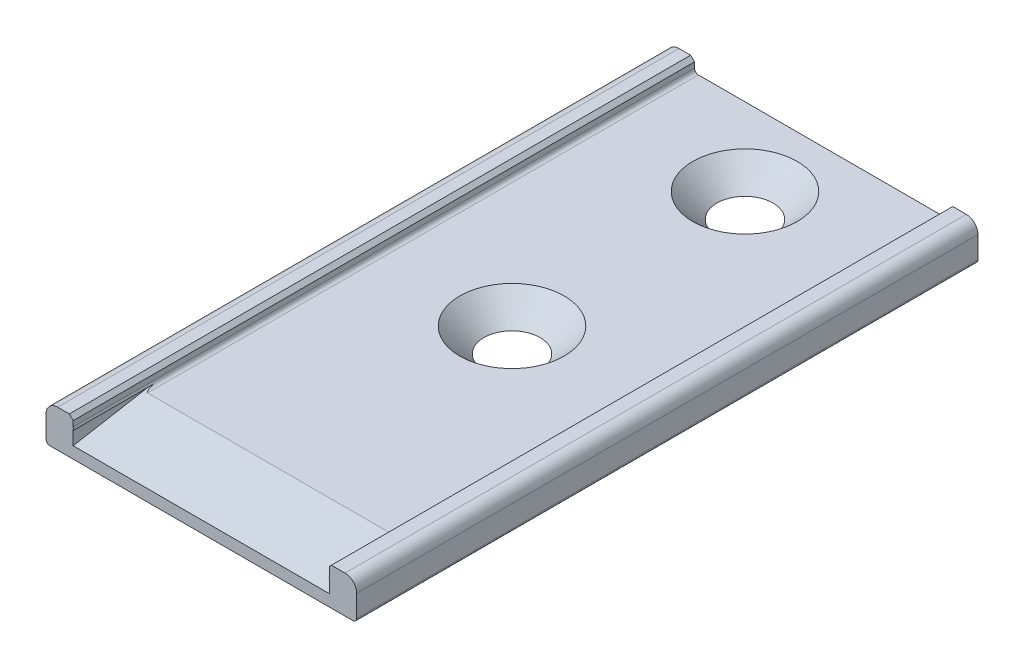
ISO-10303-21;
HEADER;
FILE_DESCRIPTION(('STEP AP214'),'2;1');
FILE_NAME('part.step','',(''),(''),'','','');
FILE_SCHEMA(('AUTOMOTIVE_DESIGN { 1 0 10303 214 1 1 1 1 }'));
ENDSEC;
DATA;
#1=APPLICATION_CONTEXT('core data for automotive mechanical design processes');
#2=APPLICATION_PROTOCOL_DEFINITION('international standard','automotive_design',2000,#1);
#3=PRODUCT_CONTEXT('',#1,'mechanical');
#4=PRODUCT('Part','Part','',(#3));
#5=PRODUCT_RELATED_PRODUCT_CATEGORY('part','',(#4));
#6=PRODUCT_DEFINITION_FORMATION('','',#4);
#7=PRODUCT_DEFINITION_CONTEXT('part definition',#1,'design');
#8=PRODUCT_DEFINITION('design','',#6,#7);
#9=PRODUCT_DEFINITION_SHAPE('','',#8);
#10=(LENGTH_UNIT() NAMED_UNIT(*) SI_UNIT(.MILLI.,.METRE.));
#11=(NAMED_UNIT(*) PLANE_ANGLE_UNIT() SI_UNIT($,.RADIAN.));
#12=(NAMED_UNIT(*) SI_UNIT($,.STERADIAN.) SOLID_ANGLE_UNIT());
#13=UNCERTAINTY_MEASURE_WITH_UNIT(LENGTH_MEASURE(1.E-05),#10,'distance_accuracy_value','');
#14=(GEOMETRIC_REPRESENTATION_CONTEXT(3) GLOBAL_UNCERTAINTY_ASSIGNED_CONTEXT((#13)) GLOBAL_UNIT_ASSIGNED_CONTEXT((#10,
#11,#12)) REPRESENTATION_CONTEXT('',''));
#15=CARTESIAN_POINT('',(0.,0.,0.));
#16=DIRECTION('',(0.,0.,1.));
#17=DIRECTION('',(1.,0.,0.));
#18=AXIS2_PLACEMENT_3D('',#15,#16,#17);
#19=CARTESIAN_POINT('',(39.5,0.5,-80.));
#20=DIRECTION('',(0.,0.,1.));
#21=DIRECTION('',(1.,0.,0.));
#22=AXIS2_PLACEMENT_3D('',#19,#20,#21);
#23=CYLINDRICAL_SURFACE('',#22,0.5);
#24=CARTESIAN_POINT('',(39.5,0.5,0.));
#25=DIRECTION('',(0.,0.,1.));
#26=DIRECTION('',(1.,0.,0.));
#27=AXIS2_PLACEMENT_3D('',#24,#25,#26);
#28=CIRCLE('',#27,0.5);
#29=CARTESIAN_POINT('',(39.5,0.,0.));
#30=VERTEX_POINT('',#29);
#31=CARTESIAN_POINT('',(40.,0.500000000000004,0.));
#32=VERTEX_POINT('',#31);
#33=EDGE_CURVE('E269',#30,#32,#28,.T.);
#34=ORIENTED_EDGE('',*,*,#33,.F.);
#35=DIRECTION('',(0.,0.,1.));
#36=VECTOR('',#35,1.);
#37=CARTESIAN_POINT('',(39.5,0.,-80.));
#38=LINE('',#37,#36);
#39=CARTESIAN_POINT('',(39.5,0.,-80.));
#40=VERTEX_POINT('',#39);
#41=EDGE_CURVE('E114',#40,#30,#38,.T.);
#42=ORIENTED_EDGE('',*,*,#41,.F.);
#43=CARTESIAN_POINT('',(39.5,0.5,-80.));
#44=DIRECTION('',(0.,0.,1.));
#45=DIRECTION('',(1.,0.,0.));
#46=AXIS2_PLACEMENT_3D('',#43,#44,#45);
#47=CIRCLE('',#46,0.5);
#48=CARTESIAN_POINT('',(40.,0.500000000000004,-80.));
#49=VERTEX_POINT('',#48);
#50=EDGE_CURVE('E326',#40,#49,#47,.T.);
#51=ORIENTED_EDGE('',*,*,#50,.T.);
#52=DIRECTION('',(0.,0.,1.));
#53=VECTOR('',#52,1.);
#54=CARTESIAN_POINT('',(40.,0.500000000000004,-80.));
#55=LINE('',#54,#53);
#56=EDGE_CURVE('E179',#49,#32,#55,.T.);
#57=ORIENTED_EDGE('',*,*,#56,.T.);
#58=EDGE_LOOP('',(#34,#42,#51,#57));
#59=FACE_BOUND('',#58,.T.);
#60=ADVANCED_FACE('F86',(#59),#23,.T.);
#61=CARTESIAN_POINT('',(0.500000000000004,0.,-80.));
#62=DIRECTION('',(0.,-1.,0.));
#63=DIRECTION('',(0.,0.,-1.));
#64=AXIS2_PLACEMENT_3D('',#61,#62,#63);
#65=PLANE('',#64);
#66=CARTESIAN_POINT('',(20.,0.,-40.));
#67=DIRECTION('',(0.,-1.,0.));
#68=DIRECTION('',(0.,0.,-1.));
#69=AXIS2_PLACEMENT_3D('',#66,#67,#68);
#70=CIRCLE('',#69,3.61999999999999);
#71=CARTESIAN_POINT('',(20.,0.,-43.62));
#72=VERTEX_POINT('',#71);
#73=EDGE_CURVE('E444',#72,#72,#70,.T.);
#74=ORIENTED_EDGE('',*,*,#73,.F.);
#75=EDGE_LOOP('',(#74));
#76=FACE_BOUND('',#75,.T.);
#77=CARTESIAN_POINT('',(20.,0.,-70.));
#78=DIRECTION('',(0.,-1.,0.));
#79=DIRECTION('',(0.,0.,-1.));
#80=AXIS2_PLACEMENT_3D('',#77,#78,#79);
#81=CIRCLE('',#80,3.61999999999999);
#82=CARTESIAN_POINT('',(20.,0.,-73.62));
#83=VERTEX_POINT('',#82);
#84=EDGE_CURVE('E274',#83,#83,#81,.T.);
#85=ORIENTED_EDGE('',*,*,#84,.F.);
#86=EDGE_LOOP('',(#85));
#87=FACE_BOUND('',#86,.T.);
#88=DIRECTION('',(1.,0.,0.));
#89=VECTOR('',#88,1.);
#90=CARTESIAN_POINT('',(0.500000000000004,0.,0.));
#91=LINE('',#90,#89);
#92=CARTESIAN_POINT('',(0.500000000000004,0.,0.));
#93=VERTEX_POINT('',#92);
#94=EDGE_CURVE('E322',#93,#30,#91,.T.);
#95=ORIENTED_EDGE('',*,*,#94,.F.);
#96=DIRECTION('',(0.,0.,1.));
#97=VECTOR('',#96,1.);
#98=CARTESIAN_POINT('',(0.500000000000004,0.,-80.));
#99=LINE('',#98,#97);
#100=CARTESIAN_POINT('',(0.500000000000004,0.,-80.));
#101=VERTEX_POINT('',#100);
#102=EDGE_CURVE('E246',#101,#93,#99,.T.);
#103=ORIENTED_EDGE('',*,*,#102,.F.);
#104=DIRECTION('',(1.,0.,0.));
#105=VECTOR('',#104,1.);
#106=CARTESIAN_POINT('',(0.500000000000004,0.,-80.));
#107=LINE('',#106,#105);
#108=EDGE_CURVE('E255',#101,#40,#107,.T.);
#109=ORIENTED_EDGE('',*,*,#108,.T.);
#110=ORIENTED_EDGE('',*,*,#41,.T.);
#111=EDGE_LOOP('',(#95,#103,#109,#110));
#112=FACE_BOUND('',#111,.T.);
#113=ADVANCED_FACE('F555',(#76,#87,#112),#65,.T.);
#114=CARTESIAN_POINT('',(0.5,0.5,-80.));
#115=DIRECTION('',(0.,0.,1.));
#116=DIRECTION('',(1.,0.,0.));
#117=AXIS2_PLACEMENT_3D('',#114,#115,#116);
#118=CYLINDRICAL_SURFACE('',#117,0.5);
#119=CARTESIAN_POINT('',(0.5,0.5,0.));
#120=DIRECTION('',(0.,0.,1.));
#121=DIRECTION('',(1.,0.,0.));
#122=AXIS2_PLACEMENT_3D('',#119,#120,#121);
#123=CIRCLE('',#122,0.5);
#124=CARTESIAN_POINT('',(0.,0.500000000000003,0.));
#125=VERTEX_POINT('',#124);
#126=EDGE_CURVE('E240',#125,#93,#123,.T.);
#127=ORIENTED_EDGE('',*,*,#126,.F.);
#128=DIRECTION('',(0.,0.,1.));
#129=VECTOR('',#128,1.);
#130=CARTESIAN_POINT('',(0.,0.500000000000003,-80.));
#131=LINE('',#130,#129);
#132=CARTESIAN_POINT('',(0.,0.500000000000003,-80.));
#133=VERTEX_POINT('',#132);
#134=EDGE_CURVE('E234',#133,#125,#131,.T.);
#135=ORIENTED_EDGE('',*,*,#134,.F.);
#136=CARTESIAN_POINT('',(0.5,0.5,-80.));
#137=DIRECTION('',(0.,0.,1.));
#138=DIRECTION('',(1.,0.,0.));
#139=AXIS2_PLACEMENT_3D('',#136,#137,#138);
#140=CIRCLE('',#139,0.5);
#141=EDGE_CURVE('E237',#133,#101,#140,.T.);
#142=ORIENTED_EDGE('',*,*,#141,.T.);
#143=ORIENTED_EDGE('',*,*,#102,.T.);
#144=EDGE_LOOP('',(#127,#135,#142,#143));
#145=FACE_BOUND('',#144,.T.);
#146=ADVANCED_FACE('F236',(#145),#118,.T.);
#147=CARTESIAN_POINT('',(0.,0.500000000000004,-80.));
#148=DIRECTION('',(-1.,0.,0.));
#149=DIRECTION('',(0.,0.,1.));
#150=AXIS2_PLACEMENT_3D('',#147,#148,#149);
#151=PLANE('',#150);
#152=DIRECTION('',(0.,-1.,0.));
#153=VECTOR('',#152,1.);
#154=CARTESIAN_POINT('',(0.,0.500000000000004,0.));
#155=LINE('',#154,#153);
#156=CARTESIAN_POINT('',(0.,3.3,0.));
#157=VERTEX_POINT('',#156);
#158=EDGE_CURVE('E317',#157,#125,#155,.T.);
#159=ORIENTED_EDGE('',*,*,#158,.F.);
#160=DIRECTION('',(0.,0.,1.));
#161=VECTOR('',#160,1.);
#162=CARTESIAN_POINT('',(0.,3.3,-80.));
#163=LINE('',#162,#161);
#164=CARTESIAN_POINT('',(0.,3.3,-80.));
#165=VERTEX_POINT('',#164);
#166=EDGE_CURVE('E247',#165,#157,#163,.T.);
#167=ORIENTED_EDGE('',*,*,#166,.F.);
#168=DIRECTION('',(0.,-1.,0.));
#169=VECTOR('',#168,1.);
#170=CARTESIAN_POINT('',(0.,0.500000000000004,-80.));
#171=LINE('',#170,#169);
#172=EDGE_CURVE('E253',#165,#133,#171,.T.);
#173=ORIENTED_EDGE('',*,*,#172,.T.);
#174=ORIENTED_EDGE('',*,*,#134,.T.);
#175=EDGE_LOOP('',(#159,#167,#173,#174));
#176=FACE_BOUND('',#175,.T.);
#177=ADVANCED_FACE('F258',(#176),#151,.T.);
#178=CARTESIAN_POINT('',(1.5,3.3,-80.));
#179=DIRECTION('',(0.,0.,1.));
#180=DIRECTION('',(1.,0.,0.));
#181=AXIS2_PLACEMENT_3D('',#178,#179,#180);
#182=CYLINDRICAL_SURFACE('',#181,1.5);
#183=CARTESIAN_POINT('',(1.5,3.3,0.));
#184=DIRECTION('',(0.,0.,1.));
#185=DIRECTION('',(-1.,0.,0.));
#186=AXIS2_PLACEMENT_3D('',#183,#184,#185);
#187=CIRCLE('',#186,1.5);
#188=CARTESIAN_POINT('',(1.5,4.8,0.));
#189=VERTEX_POINT('',#188);
#190=EDGE_CURVE('E313',#189,#157,#187,.T.);
#191=ORIENTED_EDGE('',*,*,#190,.F.);
#192=DIRECTION('',(0.,0.,1.));
#193=VECTOR('',#192,1.);
#194=CARTESIAN_POINT('',(1.5,4.8,-80.));
#195=LINE('',#194,#193);
#196=CARTESIAN_POINT('',(1.5,4.8,-80.));
#197=VERTEX_POINT('',#196);
#198=EDGE_CURVE('E334',#197,#189,#195,.T.);
#199=ORIENTED_EDGE('',*,*,#198,.F.);
#200=CARTESIAN_POINT('',(1.5,3.3,-80.));
#201=DIRECTION('',(0.,0.,1.));
#202=DIRECTION('',(-1.,0.,0.));
#203=AXIS2_PLACEMENT_3D('',#200,#201,#202);
#204=CIRCLE('',#203,1.5);
#205=EDGE_CURVE('E260',#197,#165,#204,.T.);
#206=ORIENTED_EDGE('',*,*,#205,.T.);
#207=ORIENTED_EDGE('',*,*,#166,.T.);
#208=EDGE_LOOP('',(#191,#199,#206,#207));
#209=FACE_BOUND('',#208,.T.);
#210=ADVANCED_FACE('F562',(#209),#182,.T.);
#211=CARTESIAN_POINT('',(1.5,4.8,-80.));
#212=DIRECTION('',(0.,1.,0.));
#213=DIRECTION('',(-1.,0.,0.));
#214=AXIS2_PLACEMENT_3D('',#211,#212,#213);
#215=PLANE('',#214);
#216=DIRECTION('',(-1.,0.,0.));
#217=VECTOR('',#216,1.);
#218=CARTESIAN_POINT('',(1.5,4.8,0.));
#219=LINE('',#218,#217);
#220=CARTESIAN_POINT('',(3.,4.8,0.));
#221=VERTEX_POINT('',#220);
#222=EDGE_CURVE('E309',#221,#189,#219,.T.);
#223=ORIENTED_EDGE('',*,*,#222,.F.);
#224=DIRECTION('',(0.,0.,1.));
#225=VECTOR('',#224,1.);
#226=CARTESIAN_POINT('',(3.,4.8,-80.));
#227=LINE('',#226,#225);
#228=CARTESIAN_POINT('',(3.,4.8,-80.));
#229=VERTEX_POINT('',#228);
#230=EDGE_CURVE('E337',#229,#221,#227,.T.);
#231=ORIENTED_EDGE('',*,*,#230,.F.);
#232=DIRECTION('',(-1.,0.,0.));
#233=VECTOR('',#232,1.);
#234=CARTESIAN_POINT('',(1.5,4.8,-80.));
#235=LINE('',#234,#233);
#236=EDGE_CURVE('E263',#229,#197,#235,.T.);
#237=ORIENTED_EDGE('',*,*,#236,.T.);
#238=ORIENTED_EDGE('',*,*,#198,.T.);
#239=EDGE_LOOP('',(#223,#231,#237,#238));
#240=FACE_BOUND('',#239,.T.);
#241=ADVANCED_FACE('F500',(#240),#215,.T.);
#242=CARTESIAN_POINT('',(3.,4.8,-80.));
#243=DIRECTION('',(0.707106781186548,0.707106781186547,0.));
#244=DIRECTION('',(-0.707106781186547,0.707106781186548,0.));
#245=AXIS2_PLACEMENT_3D('',#242,#243,#244);
#246=PLANE('',#245);
#247=DIRECTION('',(-0.707106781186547,0.707106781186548,0.));
#248=VECTOR('',#247,1.);
#249=CARTESIAN_POINT('',(3.,4.8,0.));
#250=LINE('',#249,#248);
#251=CARTESIAN_POINT('',(3.5,4.3,0.));
#252=VERTEX_POINT('',#251);
#253=EDGE_CURVE('E305',#252,#221,#250,.T.);
#254=ORIENTED_EDGE('',*,*,#253,.F.);
#255=DIRECTION('',(0.,0.,1.));
#256=VECTOR('',#255,1.);
#257=CARTESIAN_POINT('',(3.5,4.3,-80.));
#258=LINE('',#257,#256);
#259=CARTESIAN_POINT('',(3.5,4.3,-80.));
#260=VERTEX_POINT('',#259);
#261=EDGE_CURVE('E340',#260,#252,#258,.T.);
#262=ORIENTED_EDGE('',*,*,#261,.F.);
#263=DIRECTION('',(-0.707106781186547,0.707106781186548,0.));
#264=VECTOR('',#263,1.);
#265=CARTESIAN_POINT('',(3.,4.8,-80.));
#266=LINE('',#265,#264);
#267=EDGE_CURVE('E492',#260,#229,#266,.T.);
#268=ORIENTED_EDGE('',*,*,#267,.T.);
#269=ORIENTED_EDGE('',*,*,#230,.T.);
#270=EDGE_LOOP('',(#254,#262,#268,#269));
#271=FACE_BOUND('',#270,.T.);
#272=ADVANCED_FACE('F506',(#271),#246,.T.);
#273=CARTESIAN_POINT('',(3.5,4.3,-80.));
#274=DIRECTION('',(1.,0.,0.));
#275=DIRECTION('',(0.,1.,0.));
#276=AXIS2_PLACEMENT_3D('',#273,#274,#275);
#277=PLANE('',#276);
#278=DIRECTION('',(0.,1.,0.));
#279=VECTOR('',#278,1.);
#280=CARTESIAN_POINT('',(3.5,4.3,0.));
#281=LINE('',#280,#279);
#282=CARTESIAN_POINT('',(3.5,3.6,0.));
#283=VERTEX_POINT('',#282);
#284=EDGE_CURVE('E301',#283,#252,#281,.T.);
#285=ORIENTED_EDGE('',*,*,#284,.F.);
#286=DIRECTION('',(0.,0.,1.));
#287=VECTOR('',#286,1.);
#288=CARTESIAN_POINT('',(3.5,3.6,-80.));
#289=LINE('',#288,#287);
#290=CARTESIAN_POINT('',(3.5,3.6,-80.));
#291=VERTEX_POINT('',#290);
#292=EDGE_CURVE('E343',#291,#283,#289,.T.);
#293=ORIENTED_EDGE('',*,*,#292,.F.);
#294=DIRECTION('',(0.,1.,0.));
#295=VECTOR('',#294,1.);
#296=CARTESIAN_POINT('',(3.5,4.3,-80.));
#297=LINE('',#296,#295);
#298=EDGE_CURVE('E488',#291,#260,#297,.T.);
#299=ORIENTED_EDGE('',*,*,#298,.T.);
#300=ORIENTED_EDGE('',*,*,#261,.T.);
#301=EDGE_LOOP('',(#285,#293,#299,#300));
#302=FACE_BOUND('',#301,.T.);
#303=ADVANCED_FACE('F509',(#302),#277,.T.);
#304=CARTESIAN_POINT('',(4.,3.6,-80.));
#305=DIRECTION('',(0.,0.,1.));
#306=DIRECTION('',(1.,0.,0.));
#307=AXIS2_PLACEMENT_3D('',#304,#305,#306);
#308=CYLINDRICAL_SURFACE('',#307,0.5);
#309=DIRECTION('',(0.,0.,1.));
#310=VECTOR('',#309,1.);
#311=CARTESIAN_POINT('',(3.6,3.3,-80.));
#312=LINE('',#311,#310);
#313=CARTESIAN_POINT('',(3.60000000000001,3.29999999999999,-10.2083072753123));
#314=VERTEX_POINT('',#313);
#315=CARTESIAN_POINT('',(3.60000000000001,3.29999999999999,0.));
#316=VERTEX_POINT('',#315);
#317=EDGE_CURVE('E433',#314,#316,#312,.T.);
#318=ORIENTED_EDGE('',*,*,#317,.F.);
#319=CARTESIAN_POINT('',(4.,3.6,-11.9096918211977));
#320=DIRECTION('',(0.,-0.984807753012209,-0.173648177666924));
#321=DIRECTION('',(0.,-0.173648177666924,0.984807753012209));
#322=AXIS2_PLACEMENT_3D('',#319,#320,#321);
#323=ELLIPSE('',#322,2.87938524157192,0.5);
#324=CARTESIAN_POINT('',(4.,3.1,-9.07405091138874));
#325=VERTEX_POINT('',#324);
#326=EDGE_CURVE('E430',#325,#314,#323,.T.);
#327=ORIENTED_EDGE('',*,*,#326,.F.);
#328=DIRECTION('',(0.,0.,1.));
#329=VECTOR('',#328,1.);
#330=CARTESIAN_POINT('',(4.,3.1,-80.));
#331=LINE('',#330,#329);
#332=CARTESIAN_POINT('',(4.,3.1,-80.));
#333=VERTEX_POINT('',#332);
#334=EDGE_CURVE('E347',#333,#325,#331,.T.);
#335=ORIENTED_EDGE('',*,*,#334,.F.);
#336=CARTESIAN_POINT('',(4.,3.6,-80.));
#337=DIRECTION('',(0.,0.,-1.));
#338=DIRECTION('',(1.,0.,0.));
#339=AXIS2_PLACEMENT_3D('',#336,#337,#338);
#340=CIRCLE('',#339,0.5);
#341=EDGE_CURVE('E484',#333,#291,#340,.T.);
#342=ORIENTED_EDGE('',*,*,#341,.T.);
#343=ORIENTED_EDGE('',*,*,#292,.T.);
#344=CARTESIAN_POINT('',(4.,3.6,0.));
#345=DIRECTION('',(0.,0.,-1.));
#346=DIRECTION('',(1.,0.,0.));
#347=AXIS2_PLACEMENT_3D('',#344,#345,#346);
#348=CIRCLE('',#347,0.5);
#349=EDGE_CURVE('E298',#316,#283,#348,.T.);
#350=ORIENTED_EDGE('',*,*,#349,.F.);
#351=EDGE_LOOP('',(#318,#327,#335,#342,#343,#350));
#352=FACE_BOUND('',#351,.T.);
#353=ADVANCED_FACE('F514',(#352),#308,.F.);
#354=CARTESIAN_POINT('',(4.,3.1,-80.));
#355=DIRECTION('',(0.,1.,0.));
#356=DIRECTION('',(0.,0.,1.));
#357=AXIS2_PLACEMENT_3D('',#354,#355,#356);
#358=PLANE('',#357);
#359=DIRECTION('',(-1.,0.,0.));
#360=VECTOR('',#359,1.);
#361=CARTESIAN_POINT('',(3.99999999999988,3.1,-9.07405091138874));
#362=LINE('',#361,#360);
#363=CARTESIAN_POINT('',(36.,3.1,-9.07405091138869));
#364=VERTEX_POINT('',#363);
#365=EDGE_CURVE('E426',#364,#325,#362,.T.);
#366=ORIENTED_EDGE('',*,*,#365,.F.);
#367=DIRECTION('',(0.,0.,1.));
#368=VECTOR('',#367,1.);
#369=CARTESIAN_POINT('',(36.,3.1,-80.));
#370=LINE('',#369,#368);
#371=CARTESIAN_POINT('',(36.,3.1,-80.));
#372=VERTEX_POINT('',#371);
#373=EDGE_CURVE('E351',#372,#364,#370,.T.);
#374=ORIENTED_EDGE('',*,*,#373,.F.);
#375=DIRECTION('',(-1.,0.,0.));
#376=VECTOR('',#375,1.);
#377=CARTESIAN_POINT('',(4.,3.1,-80.));
#378=LINE('',#377,#376);
#379=EDGE_CURVE('E480',#372,#333,#378,.T.);
#380=ORIENTED_EDGE('',*,*,#379,.T.);
#381=ORIENTED_EDGE('',*,*,#334,.T.);
#382=EDGE_LOOP('',(#366,#374,#380,#381));
#383=FACE_BOUND('',#382,.T.);
#384=CARTESIAN_POINT('',(20.,3.1,-40.));
#385=DIRECTION('',(0.,1.,0.));
#386=DIRECTION('',(0.,0.,1.));
#387=AXIS2_PLACEMENT_3D('',#384,#385,#386);
#388=CIRCLE('',#387,6.72);
#389=CARTESIAN_POINT('',(20.,3.1,-33.28));
#390=VERTEX_POINT('',#389);
#391=EDGE_CURVE('E440',#390,#390,#388,.T.);
#392=ORIENTED_EDGE('',*,*,#391,.F.);
#393=EDGE_LOOP('',(#392));
#394=FACE_BOUND('',#393,.T.);
#395=CARTESIAN_POINT('',(20.,3.1,-70.));
#396=DIRECTION('',(0.,1.,0.));
#397=DIRECTION('',(0.,0.,1.));
#398=AXIS2_PLACEMENT_3D('',#395,#396,#397);
#399=CIRCLE('',#398,6.72);
#400=CARTESIAN_POINT('',(20.,3.1,-63.28));
#401=VERTEX_POINT('',#400);
#402=EDGE_CURVE('E448',#401,#401,#399,.T.);
#403=ORIENTED_EDGE('',*,*,#402,.F.);
#404=EDGE_LOOP('',(#403));
#405=FACE_BOUND('',#404,.T.);
#406=ADVANCED_FACE('F520',(#383,#394,#405),#358,.T.);
#407=CARTESIAN_POINT('',(36.,3.6,-80.));
#408=DIRECTION('',(0.,0.,1.));
#409=DIRECTION('',(1.,0.,0.));
#410=AXIS2_PLACEMENT_3D('',#407,#408,#409);
#411=CYLINDRICAL_SURFACE('',#410,0.5);
#412=DIRECTION('',(0.,0.,1.));
#413=VECTOR('',#412,1.);
#414=CARTESIAN_POINT('',(36.4,3.30000000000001,-80.));
#415=LINE('',#414,#413);
#416=CARTESIAN_POINT('',(36.4,3.3,0.));
#417=VERTEX_POINT('',#416);
#418=CARTESIAN_POINT('',(36.4,3.3,-10.2083072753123));
#419=VERTEX_POINT('',#418);
#420=EDGE_CURVE('E437',#417,#419,#415,.F.);
#421=ORIENTED_EDGE('',*,*,#420,.F.);
#422=CARTESIAN_POINT('',(36.,3.6,0.));
#423=DIRECTION('',(0.,0.,-1.));
#424=DIRECTION('',(-1.,0.,0.));
#425=AXIS2_PLACEMENT_3D('',#422,#423,#424);
#426=CIRCLE('',#425,0.5);
#427=CARTESIAN_POINT('',(36.5,3.6,0.));
#428=VERTEX_POINT('',#427);
#429=EDGE_CURVE('E294',#428,#417,#426,.T.);
#430=ORIENTED_EDGE('',*,*,#429,.F.);
#431=DIRECTION('',(0.,0.,1.));
#432=VECTOR('',#431,1.);
#433=CARTESIAN_POINT('',(36.5,3.6,-80.));
#434=LINE('',#433,#432);
#435=CARTESIAN_POINT('',(36.5,3.6,-80.));
#436=VERTEX_POINT('',#435);
#437=EDGE_CURVE('E355',#436,#428,#434,.T.);
#438=ORIENTED_EDGE('',*,*,#437,.F.);
#439=CARTESIAN_POINT('',(36.,3.6,-80.));
#440=DIRECTION('',(0.,0.,-1.));
#441=DIRECTION('',(-1.,0.,0.));
#442=AXIS2_PLACEMENT_3D('',#439,#440,#441);
#443=CIRCLE('',#442,0.5);
#444=EDGE_CURVE('E476',#436,#372,#443,.T.);
#445=ORIENTED_EDGE('',*,*,#444,.T.);
#446=ORIENTED_EDGE('',*,*,#373,.T.);
#447=CARTESIAN_POINT('',(36.,3.6,-11.9096918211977));
#448=DIRECTION('',(0.,-0.984807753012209,-0.173648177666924));
#449=DIRECTION('',(0.,-0.173648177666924,0.984807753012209));
#450=AXIS2_PLACEMENT_3D('',#447,#448,#449);
#451=ELLIPSE('',#450,2.87938524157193,0.5);
#452=EDGE_CURVE('E422',#419,#364,#451,.T.);
#453=ORIENTED_EDGE('',*,*,#452,.F.);
#454=EDGE_LOOP('',(#421,#430,#438,#445,#446,#453));
#455=FACE_BOUND('',#454,.T.);
#456=ADVANCED_FACE('F581',(#455),#411,.F.);
#457=CARTESIAN_POINT('',(36.5,4.55,-80.));
#458=DIRECTION('',(-1.,0.,0.));
#459=DIRECTION('',(0.,0.,1.));
#460=AXIS2_PLACEMENT_3D('',#457,#458,#459);
#461=PLANE('',#460);
#462=DIRECTION('',(0.,-1.,0.));
#463=VECTOR('',#462,1.);
#464=CARTESIAN_POINT('',(36.5,4.55,0.));
#465=LINE('',#464,#463);
#466=CARTESIAN_POINT('',(36.5,4.55,0.));
#467=VERTEX_POINT('',#466);
#468=EDGE_CURVE('E290',#467,#428,#465,.T.);
#469=ORIENTED_EDGE('',*,*,#468,.F.);
#470=DIRECTION('',(0.,0.,1.));
#471=VECTOR('',#470,1.);
#472=CARTESIAN_POINT('',(36.5,4.55,-80.));
#473=LINE('',#472,#471);
#474=CARTESIAN_POINT('',(36.5,4.55,-80.));
#475=VERTEX_POINT('',#474);
#476=EDGE_CURVE('E358',#475,#467,#473,.T.);
#477=ORIENTED_EDGE('',*,*,#476,.F.);
#478=DIRECTION('',(0.,-1.,0.));
#479=VECTOR('',#478,1.);
#480=CARTESIAN_POINT('',(36.5,4.55,-80.));
#481=LINE('',#480,#479);
#482=EDGE_CURVE('E472',#475,#436,#481,.T.);
#483=ORIENTED_EDGE('',*,*,#482,.T.);
#484=ORIENTED_EDGE('',*,*,#437,.T.);
#485=EDGE_LOOP('',(#469,#477,#483,#484));
#486=FACE_BOUND('',#485,.T.);
#487=ADVANCED_FACE('F584',(#486),#461,.T.);
#488=CARTESIAN_POINT('',(36.75,4.8,-80.));
#489=DIRECTION('',(-0.707106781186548,0.707106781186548,0.));
#490=DIRECTION('',(-0.707106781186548,-0.707106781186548,0.));
#491=AXIS2_PLACEMENT_3D('',#488,#489,#490);
#492=PLANE('',#491);
#493=DIRECTION('',(-0.707106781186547,-0.707106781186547,0.));
#494=VECTOR('',#493,1.);
#495=CARTESIAN_POINT('',(36.75,4.8,0.));
#496=LINE('',#495,#494);
#497=CARTESIAN_POINT('',(36.75,4.8,0.));
#498=VERTEX_POINT('',#497);
#499=EDGE_CURVE('E286',#498,#467,#496,.T.);
#500=ORIENTED_EDGE('',*,*,#499,.F.);
#501=DIRECTION('',(0.,0.,1.));
#502=VECTOR('',#501,1.);
#503=CARTESIAN_POINT('',(36.75,4.8,-80.));
#504=LINE('',#503,#502);
#505=CARTESIAN_POINT('',(36.75,4.8,-80.));
#506=VERTEX_POINT('',#505);
#507=EDGE_CURVE('E361',#506,#498,#504,.T.);
#508=ORIENTED_EDGE('',*,*,#507,.F.);
#509=DIRECTION('',(-0.707106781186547,-0.707106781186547,0.));
#510=VECTOR('',#509,1.);
#511=CARTESIAN_POINT('',(36.75,4.8,-80.));
#512=LINE('',#511,#510);
#513=EDGE_CURVE('E468',#506,#475,#512,.T.);
#514=ORIENTED_EDGE('',*,*,#513,.T.);
#515=ORIENTED_EDGE('',*,*,#476,.T.);
#516=EDGE_LOOP('',(#500,#508,#514,#515));
#517=FACE_BOUND('',#516,.T.);
#518=ADVANCED_FACE('F588',(#517),#492,.T.);
#519=CARTESIAN_POINT('',(36.75,4.8,-80.));
#520=DIRECTION('',(0.,1.,0.));
#521=DIRECTION('',(0.,0.,1.));
#522=AXIS2_PLACEMENT_3D('',#519,#520,#521);
#523=PLANE('',#522);
#524=DIRECTION('',(-1.,0.,0.));
#525=VECTOR('',#524,1.);
#526=CARTESIAN_POINT('',(36.75,4.8,0.));
#527=LINE('',#526,#525);
#528=CARTESIAN_POINT('',(38.5,4.8,0.));
#529=VERTEX_POINT('',#528);
#530=EDGE_CURVE('E282',#529,#498,#527,.T.);
#531=ORIENTED_EDGE('',*,*,#530,.F.);
#532=DIRECTION('',(0.,0.,1.));
#533=VECTOR('',#532,1.);
#534=CARTESIAN_POINT('',(38.5,4.8,-80.));
#535=LINE('',#534,#533);
#536=CARTESIAN_POINT('',(38.5,4.8,-80.));
#537=VERTEX_POINT('',#536);
#538=EDGE_CURVE('E364',#537,#529,#535,.T.);
#539=ORIENTED_EDGE('',*,*,#538,.F.);
#540=DIRECTION('',(-1.,0.,0.));
#541=VECTOR('',#540,1.);
#542=CARTESIAN_POINT('',(36.75,4.8,-80.));
#543=LINE('',#542,#541);
#544=EDGE_CURVE('E464',#537,#506,#543,.T.);
#545=ORIENTED_EDGE('',*,*,#544,.T.);
#546=ORIENTED_EDGE('',*,*,#507,.T.);
#547=EDGE_LOOP('',(#531,#539,#545,#546));
#548=FACE_BOUND('',#547,.T.);
#549=ADVANCED_FACE('F592',(#548),#523,.T.);
#550=CARTESIAN_POINT('',(38.5,3.3,-80.));
#551=DIRECTION('',(0.,0.,1.));
#552=DIRECTION('',(1.,0.,0.));
#553=AXIS2_PLACEMENT_3D('',#550,#551,#552);
#554=CYLINDRICAL_SURFACE('',#553,1.5);
#555=CARTESIAN_POINT('',(38.5,3.3,0.));
#556=DIRECTION('',(0.,0.,1.));
#557=DIRECTION('',(-1.,0.,0.));
#558=AXIS2_PLACEMENT_3D('',#555,#556,#557);
#559=CIRCLE('',#558,1.5);
#560=CARTESIAN_POINT('',(40.,3.3,0.));
#561=VERTEX_POINT('',#560);
#562=EDGE_CURVE('E278',#561,#529,#559,.T.);
#563=ORIENTED_EDGE('',*,*,#562,.F.);
#564=DIRECTION('',(0.,0.,1.));
#565=VECTOR('',#564,1.);
#566=CARTESIAN_POINT('',(40.,3.3,-80.));
#567=LINE('',#566,#565);
#568=CARTESIAN_POINT('',(40.,3.3,-80.));
#569=VERTEX_POINT('',#568);
#570=EDGE_CURVE('E367',#569,#561,#567,.T.);
#571=ORIENTED_EDGE('',*,*,#570,.F.);
#572=CARTESIAN_POINT('',(38.5,3.3,-80.));
#573=DIRECTION('',(0.,0.,1.));
#574=DIRECTION('',(-1.,0.,0.));
#575=AXIS2_PLACEMENT_3D('',#572,#573,#574);
#576=CIRCLE('',#575,1.5);
#577=EDGE_CURVE('E460',#569,#537,#576,.T.);
#578=ORIENTED_EDGE('',*,*,#577,.T.);
#579=ORIENTED_EDGE('',*,*,#538,.T.);
#580=EDGE_LOOP('',(#563,#571,#578,#579));
#581=FACE_BOUND('',#580,.T.);
#582=ADVANCED_FACE('F596',(#581),#554,.T.);
#583=CARTESIAN_POINT('',(40.,0.500000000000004,-80.));
#584=DIRECTION('',(1.,0.,0.));
#585=DIRECTION('',(0.,0.,-1.));
#586=AXIS2_PLACEMENT_3D('',#583,#584,#585);
#587=PLANE('',#586);
#588=DIRECTION('',(0.,1.,0.));
#589=VECTOR('',#588,1.);
#590=CARTESIAN_POINT('',(40.,0.500000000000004,0.));
#591=LINE('',#590,#589);
#592=EDGE_CURVE('E273',#32,#561,#591,.T.);
#593=ORIENTED_EDGE('',*,*,#592,.F.);
#594=ORIENTED_EDGE('',*,*,#56,.F.);
#595=DIRECTION('',(0.,1.,0.));
#596=VECTOR('',#595,1.);
#597=CARTESIAN_POINT('',(40.,0.500000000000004,-80.));
#598=LINE('',#597,#596);
#599=EDGE_CURVE('E457',#49,#569,#598,.T.);
#600=ORIENTED_EDGE('',*,*,#599,.T.);
#601=ORIENTED_EDGE('',*,*,#570,.T.);
#602=EDGE_LOOP('',(#593,#594,#600,#601));
#603=FACE_BOUND('',#602,.T.);
#604=ADVANCED_FACE('F599',(#603),#587,.T.);
#605=CARTESIAN_POINT('',(39.5,0.5,-80.));
#606=DIRECTION('',(0.,0.,1.));
#607=DIRECTION('',(1.,0.,0.));
#608=AXIS2_PLACEMENT_3D('',#605,#606,#607);
#609=PLANE('',#608);
#610=ORIENTED_EDGE('',*,*,#50,.F.);
#611=ORIENTED_EDGE('',*,*,#108,.F.);
#612=ORIENTED_EDGE('',*,*,#141,.F.);
#613=ORIENTED_EDGE('',*,*,#172,.F.);
#614=ORIENTED_EDGE('',*,*,#205,.F.);
#615=ORIENTED_EDGE('',*,*,#236,.F.);
#616=ORIENTED_EDGE('',*,*,#267,.F.);
#617=ORIENTED_EDGE('',*,*,#298,.F.);
#618=ORIENTED_EDGE('',*,*,#341,.F.);
#619=ORIENTED_EDGE('',*,*,#379,.F.);
#620=ORIENTED_EDGE('',*,*,#444,.F.);
#621=ORIENTED_EDGE('',*,*,#482,.F.);
#622=ORIENTED_EDGE('',*,*,#513,.F.);
#623=ORIENTED_EDGE('',*,*,#544,.F.);
#624=ORIENTED_EDGE('',*,*,#577,.F.);
#625=ORIENTED_EDGE('',*,*,#599,.F.);
#626=EDGE_LOOP('',(#610,#611,#612,#613,#614,#615,#616,#617,#618,#619,#620,#621,#622,#623,#624,#625));
#627=FACE_BOUND('',#626,.T.);
#628=ADVANCED_FACE('F251',(#627),#609,.F.);
#629=CARTESIAN_POINT('',(39.5,0.5,0.));
#630=DIRECTION('',(0.,0.,1.));
#631=DIRECTION('',(1.,0.,0.));
#632=AXIS2_PLACEMENT_3D('',#629,#630,#631);
#633=PLANE('',#632);
#634=DIRECTION('',(-1.,0.,0.));
#635=VECTOR('',#634,1.);
#636=CARTESIAN_POINT('',(39.5,3.3,0.));
#637=LINE('',#636,#635);
#638=CARTESIAN_POINT('',(3.5,3.29999999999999,0.));
#639=VERTEX_POINT('',#638);
#640=EDGE_CURVE('E12',#316,#639,#637,.T.);
#641=ORIENTED_EDGE('',*,*,#640,.F.);
#642=ORIENTED_EDGE('',*,*,#349,.T.);
#643=ORIENTED_EDGE('',*,*,#284,.T.);
#644=ORIENTED_EDGE('',*,*,#253,.T.);
#645=ORIENTED_EDGE('',*,*,#222,.T.);
#646=ORIENTED_EDGE('',*,*,#190,.T.);
#647=ORIENTED_EDGE('',*,*,#158,.T.);
#648=ORIENTED_EDGE('',*,*,#126,.T.);
#649=ORIENTED_EDGE('',*,*,#94,.T.);
#650=ORIENTED_EDGE('',*,*,#33,.T.);
#651=ORIENTED_EDGE('',*,*,#592,.T.);
#652=ORIENTED_EDGE('',*,*,#562,.T.);
#653=ORIENTED_EDGE('',*,*,#530,.T.);
#654=ORIENTED_EDGE('',*,*,#499,.T.);
#655=ORIENTED_EDGE('',*,*,#468,.T.);
#656=ORIENTED_EDGE('',*,*,#429,.T.);
#657=CARTESIAN_POINT('',(36.5,3.3,0.));
#658=VERTEX_POINT('',#657);
#659=EDGE_CURVE('E95',#658,#417,#637,.T.);
#660=ORIENTED_EDGE('',*,*,#659,.F.);
#661=DIRECTION('',(0.,-1.,0.));
#662=VECTOR('',#661,1.);
#663=CARTESIAN_POINT('',(36.5,0.5,0.));
#664=LINE('',#663,#662);
#665=CARTESIAN_POINT('',(36.5,1.5,0.));
#666=VERTEX_POINT('',#665);
#667=EDGE_CURVE('E329',#658,#666,#664,.T.);
#668=ORIENTED_EDGE('',*,*,#667,.T.);
#669=DIRECTION('',(1.,0.,0.));
#670=VECTOR('',#669,1.);
#671=CARTESIAN_POINT('',(3.5,1.49999999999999,0.));
#672=LINE('',#671,#670);
#673=CARTESIAN_POINT('',(3.5,1.49999999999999,0.));
#674=VERTEX_POINT('',#673);
#675=EDGE_CURVE('E405',#674,#666,#672,.T.);
#676=ORIENTED_EDGE('',*,*,#675,.F.);
#677=DIRECTION('',(0.,-1.,0.));
#678=VECTOR('',#677,1.);
#679=CARTESIAN_POINT('',(3.5,0.5,0.));
#680=LINE('',#679,#678);
#681=EDGE_CURVE('E89',#639,#674,#680,.T.);
#682=ORIENTED_EDGE('',*,*,#681,.F.);
#683=EDGE_LOOP('',(#641,#642,#643,#644,#645,#646,#647,#648,#649,#650,#651,#652,#653,#654,#655,
#656,#660,#668,#676,#682));
#684=FACE_BOUND('',#683,.T.);
#685=ADVANCED_FACE('F411',(#684),#633,.T.);
#686=CARTESIAN_POINT('',(20.,3.1,-70.));
#687=DIRECTION('',(0.,1.,0.));
#688=DIRECTION('',(0.,0.,1.));
#689=AXIS2_PLACEMENT_3D('',#686,#687,#688);
#690=CONICAL_SURFACE('',#689,6.72,0.785398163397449);
#691=ORIENTED_EDGE('',*,*,#84,.T.);
#692=EDGE_LOOP('',(#691));
#693=FACE_BOUND('',#692,.T.);
#694=ORIENTED_EDGE('',*,*,#402,.T.);
#695=EDGE_LOOP('',(#694));
#696=FACE_BOUND('',#695,.T.);
#697=ADVANCED_FACE('F617',(#693,#696),#690,.F.);
#698=CARTESIAN_POINT('',(20.,3.1,-40.));
#699=DIRECTION('',(0.,1.,0.));
#700=DIRECTION('',(0.,0.,1.));
#701=AXIS2_PLACEMENT_3D('',#698,#699,#700);
#702=CONICAL_SURFACE('',#701,6.72,0.785398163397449);
#703=ORIENTED_EDGE('',*,*,#73,.T.);
#704=EDGE_LOOP('',(#703));
#705=FACE_BOUND('',#704,.T.);
#706=ORIENTED_EDGE('',*,*,#391,.T.);
#707=EDGE_LOOP('',(#706));
#708=FACE_BOUND('',#707,.T.);
#709=ADVANCED_FACE('F729',(#705,#708),#702,.F.);
#710=CARTESIAN_POINT('',(3.5,3.29999999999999,-10.2083072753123));
#711=DIRECTION('',(0.,1.,0.));
#712=DIRECTION('',(-1.,0.,0.));
#713=AXIS2_PLACEMENT_3D('',#710,#711,#712);
#714=PLANE('',#713);
#715=ORIENTED_EDGE('',*,*,#420,.T.);
#716=DIRECTION('',(1.,0.,0.));
#717=VECTOR('',#716,1.);
#718=CARTESIAN_POINT('',(3.5,3.29999999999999,-10.2083072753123));
#719=LINE('',#718,#717);
#720=CARTESIAN_POINT('',(36.5,3.3,-10.2083072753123));
#721=VERTEX_POINT('',#720);
#722=EDGE_CURVE('E413',#419,#721,#719,.T.);
#723=ORIENTED_EDGE('',*,*,#722,.T.);
#724=DIRECTION('',(0.,0.,1.));
#725=VECTOR('',#724,1.);
#726=CARTESIAN_POINT('',(36.5,3.3,-10.2083072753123));
#727=LINE('',#726,#725);
#728=EDGE_CURVE('E409',#721,#658,#727,.T.);
#729=ORIENTED_EDGE('',*,*,#728,.T.);
#730=ORIENTED_EDGE('',*,*,#659,.T.);
#731=EDGE_LOOP('',(#715,#723,#729,#730));
#732=FACE_BOUND('',#731,.T.);
#733=ADVANCED_FACE('F541',(#732),#714,.F.);
#734=ORIENTED_EDGE('',*,*,#317,.T.);
#735=ORIENTED_EDGE('',*,*,#640,.T.);
#736=DIRECTION('',(0.,0.,1.));
#737=VECTOR('',#736,1.);
#738=CARTESIAN_POINT('',(3.5,3.29999999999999,-10.2083072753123));
#739=LINE('',#738,#737);
#740=CARTESIAN_POINT('',(3.5,3.29999999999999,-10.2083072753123));
#741=VERTEX_POINT('',#740);
#742=EDGE_CURVE('E394',#741,#639,#739,.T.);
#743=ORIENTED_EDGE('',*,*,#742,.F.);
#744=EDGE_CURVE('E407',#741,#314,#719,.T.);
#745=ORIENTED_EDGE('',*,*,#744,.T.);
#746=EDGE_LOOP('',(#734,#735,#743,#745));
#747=FACE_BOUND('',#746,.T.);
#748=ADVANCED_FACE('F744',(#747),#714,.F.);
#749=CARTESIAN_POINT('',(3.5,1.49999999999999,0.));
#750=DIRECTION('',(0.,-0.984807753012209,-0.173648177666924));
#751=DIRECTION('',(0.,0.173648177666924,-0.984807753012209));
#752=AXIS2_PLACEMENT_3D('',#749,#750,#751);
#753=PLANE('',#752);
#754=ORIENTED_EDGE('',*,*,#326,.T.);
#755=ORIENTED_EDGE('',*,*,#744,.F.);
#756=DIRECTION('',(0.,0.173648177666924,-0.984807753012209));
#757=VECTOR('',#756,1.);
#758=CARTESIAN_POINT('',(3.5,1.49999999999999,0.));
#759=LINE('',#758,#757);
#760=EDGE_CURVE('E391',#674,#741,#759,.T.);
#761=ORIENTED_EDGE('',*,*,#760,.F.);
#762=ORIENTED_EDGE('',*,*,#675,.T.);
#763=DIRECTION('',(0.,0.173648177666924,-0.984807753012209));
#764=VECTOR('',#763,1.);
#765=CARTESIAN_POINT('',(36.5,1.5,0.));
#766=LINE('',#765,#764);
#767=EDGE_CURVE('E102',#666,#721,#766,.T.);
#768=ORIENTED_EDGE('',*,*,#767,.T.);
#769=ORIENTED_EDGE('',*,*,#722,.F.);
#770=ORIENTED_EDGE('',*,*,#452,.T.);
#771=ORIENTED_EDGE('',*,*,#365,.T.);
#772=EDGE_LOOP('',(#754,#755,#761,#762,#768,#769,#770,#771));
#773=FACE_BOUND('',#772,.T.);
#774=ADVANCED_FACE('F404',(#773),#753,.F.);
#775=CARTESIAN_POINT('',(3.5,0.,0.));
#776=DIRECTION('',(-1.,0.,0.));
#777=DIRECTION('',(0.,0.,1.));
#778=AXIS2_PLACEMENT_3D('',#775,#776,#777);
#779=PLANE('',#778);
#780=ORIENTED_EDGE('',*,*,#681,.T.);
#781=ORIENTED_EDGE('',*,*,#760,.T.);
#782=ORIENTED_EDGE('',*,*,#742,.T.);
#783=EDGE_LOOP('',(#780,#781,#782));
#784=FACE_BOUND('',#783,.T.);
#785=ADVANCED_FACE('F389',(#784),#779,.F.);
#786=CARTESIAN_POINT('',(36.5,0.,0.));
#787=DIRECTION('',(-1.,0.,0.));
#788=DIRECTION('',(0.,0.,1.));
#789=AXIS2_PLACEMENT_3D('',#786,#787,#788);
#790=PLANE('',#789);
#791=ORIENTED_EDGE('',*,*,#728,.F.);
#792=ORIENTED_EDGE('',*,*,#767,.F.);
#793=ORIENTED_EDGE('',*,*,#667,.F.);
#794=EDGE_LOOP('',(#791,#792,#793));
#795=FACE_BOUND('',#794,.T.);
#796=ADVANCED_FACE('F543',(#795),#790,.T.);
#797=CLOSED_SHELL('',(#60,#113,#146,#177,#210,#241,#272,#303,#353,#406,#456,#487,#518,#549,#582,
#604,#628,#685,#697,#709,#733,#748,#774,#785,#796));
#798=MANIFOLD_SOLID_BREP('B2',#797);
#799=ADVANCED_BREP_SHAPE_REPRESENTATION('',(#18,#798),#14);
#800=SHAPE_DEFINITION_REPRESENTATION(#9,#799);
ENDSEC;
END-ISO-10303-21;
